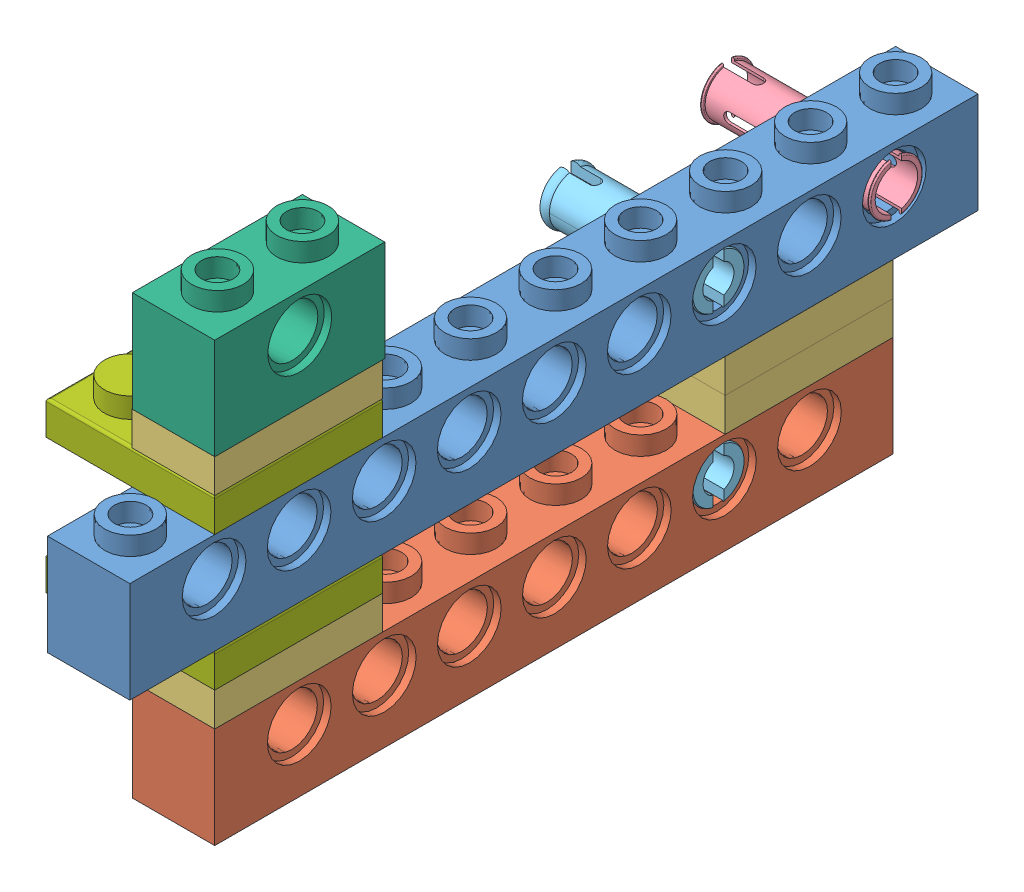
SolidWorks assembly Assem105Rechts.SLDASM, configuration Default (file format 4400). Lengths in mm.
Overall size (16.08 42.93 79.8).
12 component instances, 7 part files, 30 mates.
Components (placement in the parent):
- BASIS TECHNIEK 10 HZwart-1: BASIS TECHNIEK 10 HZwart.SLDPRT [Default] at origin size (7.75 11.25 79.8)
- BASIS TECHNIEK 8 HZwart-1: BASIS TECHNIEK 8 HZwart.SLDPRT [Default] at (0 -15.841 7.985) size (7.75 11.25 63.83)
- Part0L2Zwart-1: Part0L2Zwart.SLDPRT [Default] at (-3.925 -11.091 71.815) size (7.8 4.87 15.8)
- Part0L2Zwart-2: Part0L2Zwart.SLDPRT [Default] at (-3.925 -7.925 23.785) size (7.8 4.87 15.8)
- Part0L2Zwart-3: Part0L2Zwart.SLDPRT [Default] at (-3.925 7.925 71.815) size (7.8 4.87 15.8)
- Part0L2Zwart-4: Part0L2Zwart.SLDPRT [Default] at (-3.925 -11.091 23.785) size (7.8 4.87 15.8)
- Open Pin Zwart-1: Open Pin Zwart.SLDPRT [Défaut] at (-11.925 1.15 5.375) size (16.01 5.5 5.41)
- Pin Glashelder-1: Pin Glashelder.sldprt [Default] at (-3.175 1.15 23.875) size (14.4 5.84 5.84)
- Pin Glashelder-2: Pin Glashelder.sldprt [Default] at (-3.175 -14.691 23.86) size (14.4 5.84 5.84)
- BASIS TECHNIEK 2 HZwart-1: BASIS TECHNIEK 2 HZwart.SLDPRT [Default] at (0 15.841 55.815) size (7.75 11.25 16)
- 2x2LZwart-6: 2x2LZwart.sldprt [2x2 single] at (-4.0625 4.75 63.915) size (15.88 5.08 15.8)
- 2x2LZwart-7: 2x2LZwart.sldprt [2x2 single] at (-4.0625 -7.925 63.915) size (15.88 5.08 15.8)
Mates (geometry in assembly coordinates):
- Coincident2: coincident aligned: plane of BASIS TECHNIEK 8 HZwart-1 through (-3.875 -11.091 71.815) normal (0 0 1); plane of Part0L2Zwart-1 through (-3.925 -7.925 71.815) normal (0 0 1)
- Coincident3: coincident aligned: plane of BASIS TECHNIEK 8 HZwart-1 through (3.875 -20.591 71.815) normal (1 0 0); plane of Part0L2Zwart-1 through (3.875 -7.925 71.815) normal (1 0 0)
- Coincident4: coincident aligned: plane of BASIS TECHNIEK 8 HZwart-1 through (3.875 -20.591 71.815) normal (1 0 0); plane of Part0L2Zwart-4 through (3.875 -7.925 23.785) normal (1 0 0)
- Coincident5: coincident aligned: plane of BASIS TECHNIEK 8 HZwart-1 through (-3.875 -11.091 7.985) normal (0 0 -1); plane of Part0L2Zwart-4 through (-3.925 -7.925 7.985) normal (0 0 -1)
- Coincident6: coincident anti-aligned: plane of BASIS TECHNIEK 8 HZwart-1 through (3.875 -11.091 71.815) normal (0 1 0); plane of Part0L2Zwart-4 through (-3.925 -11.091 7.985) normal (0 -1 0)
- Coincident7: coincident anti-aligned: plane of BASIS TECHNIEK 8 HZwart-1 through (3.875 -11.091 71.815) normal (0 1 0); plane of Part0L2Zwart-1 through (-3.925 -11.091 56.015) normal (0 -1 0)
- Coincident8: coincident aligned: plane of Part0L2Zwart-2 through (-3.925 -4.759 7.985) normal (0 0 -1); plane of Part0L2Zwart-4 through (-3.925 -7.925 7.985) normal (0 0 -1)
- Coincident9: coincident aligned: plane of Part0L2Zwart-2 through (3.875 -4.759 23.785) normal (1 0 0); plane of Part0L2Zwart-4 through (3.875 -7.925 23.785) normal (1 0 0)
- Coincident10: coincident anti-aligned: plane of Part0L2Zwart-2 through (-3.925 -7.925 7.985) normal (0 -1 0); plane of Part0L2Zwart-4 through (-3.925 -7.925 7.985) normal (0 1 0)
- Coincident11: coincident aligned: plane of Part0L2Zwart-1 through (3.875 -7.925 71.815) normal (1 0 0); plane of 2x2LZwart-7 through (3.875 -4.75 71.815) normal (1 0 0)
- Coincident12: coincident aligned: plane of Part0L2Zwart-1 through (-3.925 -7.925 71.815) normal (0 0 1); plane of 2x2LZwart-7 through (3.875 -4.75 71.815) normal (0 0 1)
- Coincident13: coincident anti-aligned: plane of Part0L2Zwart-1 through (-3.925 -7.925 56.015) normal (0 1 0); plane of 2x2LZwart-7 through (-12 -7.925 71.815) normal (0 -1 0)
- Coincident14: coincident aligned: plane of BASIS TECHNIEK 10 HZwart-1 through (3.875 -4.75 79.8) normal (1 0 0); plane of 2x2LZwart-7 through (3.875 -4.75 71.815) normal (1 0 0)
- Width1: width: plane of BASIS TECHNIEK 10 HZwart-1 through (-3.875 4.75 79.8) normal (0 0 1); plane of BASIS TECHNIEK 10 HZwart-1 through (-3.875 4.75 0) normal (0 0 -1); plane of BASIS TECHNIEK 8 HZwart-1 through (-3.875 -11.091 7.985) normal (0 0 -1); plane of BASIS TECHNIEK 8 HZwart-1 through (-3.875 -11.091 71.815) normal (0 0 1)
- Coincident15: coincident anti-aligned: plane of BASIS TECHNIEK 10 HZwart-1 through (3.875 -4.75 79.8) normal (0 -1 0); plane of 2x2LZwart-7 through (-12 -4.75 71.815) normal (0 1 0)
- Coincident16: coincident aligned: plane of 2x2LZwart-6 through (3.875 7.925 71.815) normal (0 0 1); plane of 2x2LZwart-7 through (3.875 -4.75 71.815) normal (0 0 1)
- Coincident17: coincident aligned: plane of BASIS TECHNIEK 10 HZwart-1 through (3.875 -4.75 79.8) normal (1 0 0); plane of 2x2LZwart-6 through (3.875 7.925 71.815) normal (1 0 0)
- Coincident18: coincident anti-aligned: plane of BASIS TECHNIEK 10 HZwart-1 through (3.875 4.75 79.8) normal (0 1 0); plane of 2x2LZwart-6 through (-12 4.75 71.815) normal (0 -1 0)
- Coincident19: coincident aligned: plane of Part0L2Zwart-3 through (3.875 11.091 71.815) normal (1 0 0); plane of 2x2LZwart-6 through (3.875 7.925 71.815) normal (1 0 0)
- Coincident20: coincident aligned: plane of Part0L2Zwart-3 through (-3.925 11.091 71.815) normal (0 0 1); plane of 2x2LZwart-6 through (3.875 7.925 71.815) normal (0 0 1)
- Coincident21: coincident anti-aligned: plane of Part0L2Zwart-3 through (-3.925 7.925 56.015) normal (0 -1 0); plane of 2x2LZwart-6 through (-12 7.925 71.815) normal (0 1 0)
- Coincident22: coincident aligned: plane of Part0L2Zwart-3 through (-3.925 11.091 71.815) normal (0 0 1); plane of BASIS TECHNIEK 2 HZwart-1 through (-3.875 20.591 71.815) normal (0 0 1)
- Coincident23: coincident aligned: plane of Part0L2Zwart-3 through (3.875 11.091 71.815) normal (1 0 0); plane of BASIS TECHNIEK 2 HZwart-1 through (3.875 11.091 71.815) normal (1 0 0)
- Coincident24: coincident anti-aligned: plane of Part0L2Zwart-3 through (-3.925 11.091 56.015) normal (0 1 0); plane of BASIS TECHNIEK 2 HZwart-1 through (3.875 11.091 71.815) normal (0 -1 0)
- Concentric1: concentric anti-aligned: cylinder of BASIS TECHNIEK 10 HZwart-1 through (-3.875 1.15 7.875) axis (1 0 0) radius 2.4; cylinder of Open Pin Zwart-1 through (-12.5713 1.15 7.875) axis (-1 0 0) radius 2.25
- Coincident25: coincident anti-aligned: plane of BASIS TECHNIEK 10 HZwart-1 through (-3.175 1.15 7.875) normal (-1 0 0); plane of Open Pin Zwart-1 through (-3.175 1.15 5.125) normal (1 0 0)
- Concentric2: concentric anti-aligned: cylinder of BASIS TECHNIEK 10 HZwart-1 through (-3.875 1.15 23.875) axis (1 0 0) radius 2.4; cylinder of Pin Glashelder-1 through (3.325 1.15 23.875) axis (-1 0 0) radius 2.4
- Coincident26: coincident anti-aligned: plane of BASIS TECHNIEK 10 HZwart-1 through (-3.175 1.15 23.875) normal (-1 0 0); plane of Pin Glashelder-1 through (-3.175 1.15 23.875) normal (1 0 0)
- Concentric3: concentric aligned: cylinder of BASIS TECHNIEK 8 HZwart-1 through (3.875 -14.691 23.86) axis (-1 0 0) radius 2.4; cylinder of Pin Glashelder-2 through (3.325 -14.691 23.86) axis (-1 0 0) radius 2.4
- Coincident27: coincident anti-aligned: plane of BASIS TECHNIEK 8 HZwart-1 through (-3.175 -14.691 23.86) normal (-1 0 0); plane of Pin Glashelder-2 through (-3.175 -14.691 23.86) normal (1 0 0)
